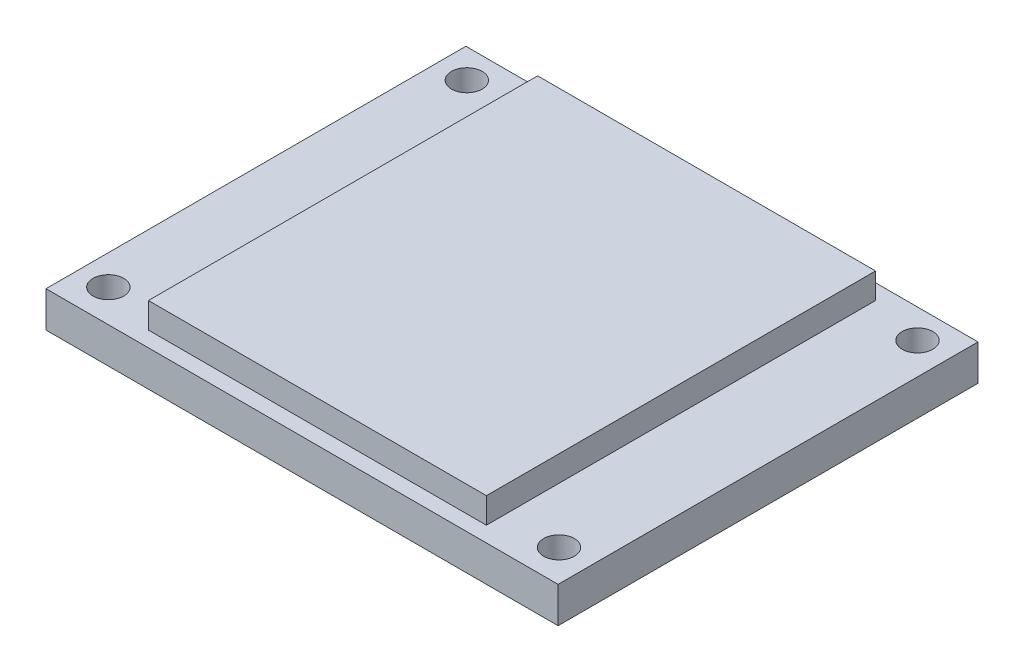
from build123d import *

# Parameters (mm, degrees)
SKETCH1_W           = 50
SKETCH1_H           = 41
BOSS_EXTRUDE1_DEPTH = 3.5
SKETCH2_R           = 1.5
CUT_EXTRUDE1_DEPTH  = 3.5
SKETCH3_W           = 33
SKETCH3_H           = 38
BOSS_EXTRUDE2_DEPTH = 2.5


with BuildPart() as part:
    # Sketch1 → Boss-Extrude1 (new body)
    with BuildSketch(Plane(origin=(0, 0, 0), x_dir=(1, 0, 0), z_dir=(0, 1, 0))):
        with Locations((2.419354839, -6.467741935)):
            Rectangle(SKETCH1_W, SKETCH1_H)
    extrude(amount=BOSS_EXTRUDE1_DEPTH)

    # Sketch2 → Cut-Extrude1 (cut)
    with BuildSketch(Plane(origin=(0, 3.5, 0), x_dir=(1, 0, 0), z_dir=(0, 1, 0))):
        with Locations(Location((-19.662393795, 11.203444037, 0), (0, 0, 270))):
            Circle(SKETCH2_R)
        with Locations(Location((-19.662393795, -23.796555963, 0), (0, 0, 270))):
            Circle(SKETCH2_R)
        with Locations(Location((24.337606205, -23.796657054, 0), (0, 0, 270))):
            Circle(SKETCH2_R)
        with Locations(Location((24.337606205, 11.203342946, 0), (0, 0, 270))):
            Circle(SKETCH2_R)
    extrude(amount=-CUT_EXTRUDE1_DEPTH, mode=Mode.SUBTRACT)

    # Sketch3 → Boss-Extrude2 (add)
    with BuildSketch(Plane(origin=(0, 3.5, 0), x_dir=(1, 0, 0), z_dir=(0, 1, 0))):
        with Locations((2.419354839, -6.467741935)):
            Rectangle(SKETCH3_W, SKETCH3_H)
    extrude(amount=BOSS_EXTRUDE2_DEPTH)


solid = part.part
